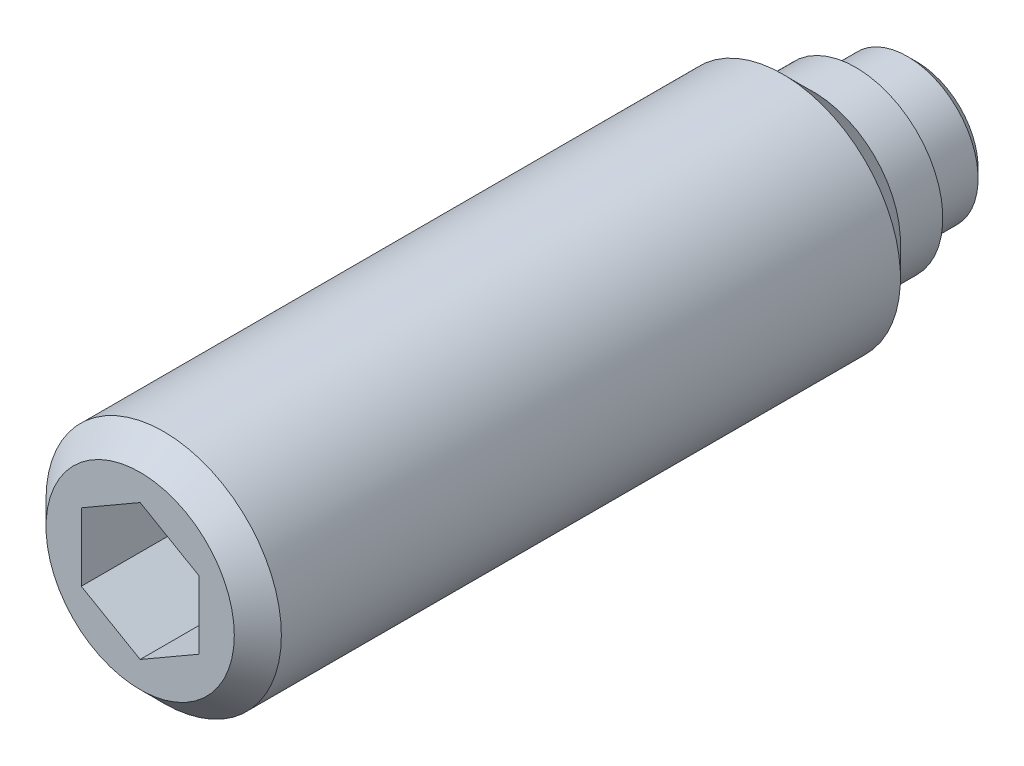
ISO-10303-21;
HEADER;
FILE_DESCRIPTION(('STEP AP214'),'2;1');
FILE_NAME('part.step','',(''),(''),'','','');
FILE_SCHEMA(('AUTOMOTIVE_DESIGN { 1 0 10303 214 1 1 1 1 }'));
ENDSEC;
DATA;
#1=APPLICATION_CONTEXT('core data for automotive mechanical design processes');
#2=APPLICATION_PROTOCOL_DEFINITION('international standard','automotive_design',2000,#1);
#3=PRODUCT_CONTEXT('',#1,'mechanical');
#4=PRODUCT('Part','Part','',(#3));
#5=PRODUCT_RELATED_PRODUCT_CATEGORY('part','',(#4));
#6=PRODUCT_DEFINITION_FORMATION('','',#4);
#7=PRODUCT_DEFINITION_CONTEXT('part definition',#1,'design');
#8=PRODUCT_DEFINITION('design','',#6,#7);
#9=PRODUCT_DEFINITION_SHAPE('','',#8);
#10=(LENGTH_UNIT() NAMED_UNIT(*) SI_UNIT(.MILLI.,.METRE.));
#11=(NAMED_UNIT(*) PLANE_ANGLE_UNIT() SI_UNIT($,.RADIAN.));
#12=(NAMED_UNIT(*) SI_UNIT($,.STERADIAN.) SOLID_ANGLE_UNIT());
#13=UNCERTAINTY_MEASURE_WITH_UNIT(LENGTH_MEASURE(1.E-05),#10,'distance_accuracy_value','');
#14=(GEOMETRIC_REPRESENTATION_CONTEXT(3) GLOBAL_UNCERTAINTY_ASSIGNED_CONTEXT((#13)) GLOBAL_UNIT_ASSIGNED_CONTEXT((#10,
#11,#12)) REPRESENTATION_CONTEXT('',''));
#15=CARTESIAN_POINT('',(0.,0.,0.));
#16=DIRECTION('',(0.,0.,1.));
#17=DIRECTION('',(1.,0.,0.));
#18=AXIS2_PLACEMENT_3D('',#15,#16,#17);
#19=CARTESIAN_POINT('',(0.,0.,1.3));
#20=DIRECTION('',(0.,0.,-1.));
#21=DIRECTION('',(-1.,0.,0.));
#22=AXIS2_PLACEMENT_3D('',#19,#20,#21);
#23=CYLINDRICAL_SURFACE('',#22,2.5);
#24=CARTESIAN_POINT('',(0.,0.,16.));
#25=DIRECTION('',(0.,0.,1.));
#26=DIRECTION('',(1.,0.,0.));
#27=AXIS2_PLACEMENT_3D('',#24,#25,#26);
#28=CIRCLE('',#27,2.5);
#29=CARTESIAN_POINT('',(2.5,0.,16.));
#30=VERTEX_POINT('',#29);
#31=EDGE_CURVE('E9',#30,#30,#28,.F.);
#32=ORIENTED_EDGE('',*,*,#31,.T.);
#33=EDGE_LOOP('',(#32));
#34=FACE_BOUND('',#33,.T.);
#35=CARTESIAN_POINT('',(0.,0.,2.85));
#36=DIRECTION('',(0.,0.,-1.));
#37=DIRECTION('',(-1.,0.,0.));
#38=AXIS2_PLACEMENT_3D('',#35,#36,#37);
#39=CIRCLE('',#38,2.5);
#40=CARTESIAN_POINT('',(-2.5,0.,2.85));
#41=VERTEX_POINT('',#40);
#42=EDGE_CURVE('E136',#41,#41,#39,.T.);
#43=ORIENTED_EDGE('',*,*,#42,.F.);
#44=EDGE_LOOP('',(#43));
#45=FACE_BOUND('',#44,.T.);
#46=ADVANCED_FACE('F14',(#34,#45),#23,.T.);
#47=CARTESIAN_POINT('',(0.,0.,2.85));
#48=DIRECTION('',(0.,0.,1.));
#49=DIRECTION('',(1.,0.,0.));
#50=AXIS2_PLACEMENT_3D('',#47,#48,#49);
#51=CONICAL_SURFACE('',#50,2.5,0.785398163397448);
#52=ORIENTED_EDGE('',*,*,#42,.T.);
#53=EDGE_LOOP('',(#52));
#54=FACE_BOUND('',#53,.T.);
#55=CARTESIAN_POINT('',(0.,0.,2.2));
#56=DIRECTION('',(0.,0.,-1.));
#57=DIRECTION('',(-1.,0.,0.));
#58=AXIS2_PLACEMENT_3D('',#55,#56,#57);
#59=CIRCLE('',#58,1.85);
#60=CARTESIAN_POINT('',(-1.85,0.,2.2));
#61=VERTEX_POINT('',#60);
#62=EDGE_CURVE('E133',#61,#61,#59,.T.);
#63=ORIENTED_EDGE('',*,*,#62,.F.);
#64=EDGE_LOOP('',(#63));
#65=FACE_BOUND('',#64,.T.);
#66=ADVANCED_FACE('F158',(#54,#65),#51,.T.);
#67=CARTESIAN_POINT('',(0.,0.,1.3));
#68=DIRECTION('',(0.,0.,-1.));
#69=DIRECTION('',(-1.,0.,0.));
#70=AXIS2_PLACEMENT_3D('',#67,#68,#69);
#71=CYLINDRICAL_SURFACE('',#70,1.85);
#72=ORIENTED_EDGE('',*,*,#62,.T.);
#73=EDGE_LOOP('',(#72));
#74=FACE_BOUND('',#73,.T.);
#75=CARTESIAN_POINT('',(0.,0.,1.3));
#76=DIRECTION('',(0.,0.,-1.));
#77=DIRECTION('',(-1.,0.,0.));
#78=AXIS2_PLACEMENT_3D('',#75,#76,#77);
#79=CIRCLE('',#78,1.85);
#80=CARTESIAN_POINT('',(-1.85,0.,1.3));
#81=VERTEX_POINT('',#80);
#82=EDGE_CURVE('E130',#81,#81,#79,.T.);
#83=ORIENTED_EDGE('',*,*,#82,.F.);
#84=EDGE_LOOP('',(#83));
#85=FACE_BOUND('',#84,.T.);
#86=ADVANCED_FACE('F163',(#74,#85),#71,.T.);
#87=CARTESIAN_POINT('',(0.,1.85,1.3));
#88=DIRECTION('',(0.,0.,1.));
#89=DIRECTION('',(1.,0.,0.));
#90=AXIS2_PLACEMENT_3D('',#87,#88,#89);
#91=PLANE('',#90);
#92=ORIENTED_EDGE('',*,*,#82,.T.);
#93=EDGE_LOOP('',(#92));
#94=FACE_BOUND('',#93,.T.);
#95=CARTESIAN_POINT('',(0.,0.,1.3));
#96=DIRECTION('',(0.,0.,-1.));
#97=DIRECTION('',(-1.,0.,0.));
#98=AXIS2_PLACEMENT_3D('',#95,#96,#97);
#99=CIRCLE('',#98,1.5);
#100=CARTESIAN_POINT('',(-1.5,0.,1.3));
#101=VERTEX_POINT('',#100);
#102=EDGE_CURVE('E127',#101,#101,#99,.T.);
#103=ORIENTED_EDGE('',*,*,#102,.F.);
#104=EDGE_LOOP('',(#103));
#105=FACE_BOUND('',#104,.T.);
#106=ADVANCED_FACE('F170',(#94,#105),#91,.F.);
#107=CARTESIAN_POINT('',(0.,0.,0.));
#108=DIRECTION('',(0.,0.,-1.));
#109=DIRECTION('',(-1.,0.,0.));
#110=AXIS2_PLACEMENT_3D('',#107,#108,#109);
#111=CYLINDRICAL_SURFACE('',#110,1.5);
#112=CARTESIAN_POINT('',(0.,0.,0.2));
#113=DIRECTION('',(0.,0.,-1.));
#114=DIRECTION('',(-1.,0.,0.));
#115=AXIS2_PLACEMENT_3D('',#112,#113,#114);
#116=CIRCLE('',#115,1.5);
#117=CARTESIAN_POINT('',(-1.5,0.,0.2));
#118=VERTEX_POINT('',#117);
#119=EDGE_CURVE('E124',#118,#118,#116,.T.);
#120=ORIENTED_EDGE('',*,*,#119,.F.);
#121=EDGE_LOOP('',(#120));
#122=FACE_BOUND('',#121,.T.);
#123=ORIENTED_EDGE('',*,*,#102,.T.);
#124=EDGE_LOOP('',(#123));
#125=FACE_BOUND('',#124,.T.);
#126=ADVANCED_FACE('F174',(#122,#125),#111,.T.);
#127=CARTESIAN_POINT('',(0.,0.,0.2));
#128=DIRECTION('',(0.,0.,1.));
#129=DIRECTION('',(1.,0.,0.));
#130=AXIS2_PLACEMENT_3D('',#127,#128,#129);
#131=CONICAL_SURFACE('',#130,1.5,0.785398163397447);
#132=CARTESIAN_POINT('',(0.,0.,0.));
#133=DIRECTION('',(0.,0.,-1.));
#134=DIRECTION('',(-1.,0.,0.));
#135=AXIS2_PLACEMENT_3D('',#132,#133,#134);
#136=CIRCLE('',#135,1.3);
#137=CARTESIAN_POINT('',(-1.3,0.,0.));
#138=VERTEX_POINT('',#137);
#139=EDGE_CURVE('E116',#138,#138,#136,.T.);
#140=ORIENTED_EDGE('',*,*,#139,.F.);
#141=EDGE_LOOP('',(#140));
#142=FACE_BOUND('',#141,.T.);
#143=ORIENTED_EDGE('',*,*,#119,.T.);
#144=EDGE_LOOP('',(#143));
#145=FACE_BOUND('',#144,.T.);
#146=ADVANCED_FACE('F178',(#142,#145),#131,.T.);
#147=CARTESIAN_POINT('',(0.,1.3,0.));
#148=DIRECTION('',(0.,0.,1.));
#149=DIRECTION('',(1.,0.,0.));
#150=AXIS2_PLACEMENT_3D('',#147,#148,#149);
#151=PLANE('',#150);
#152=ORIENTED_EDGE('',*,*,#139,.T.);
#153=EDGE_LOOP('',(#152));
#154=FACE_BOUND('',#153,.T.);
#155=ADVANCED_FACE('F153',(#154),#151,.F.);
#156=CARTESIAN_POINT('',(0.,0.,16.5));
#157=DIRECTION('',(0.,0.,1.));
#158=DIRECTION('',(1.,0.,0.));
#159=AXIS2_PLACEMENT_3D('',#156,#157,#158);
#160=PLANE('',#159);
#161=DIRECTION('',(0.866025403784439,-0.5,0.));
#162=VECTOR('',#161,1.);
#163=CARTESIAN_POINT('',(-1.25,-0.721687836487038,16.5));
#164=LINE('',#163,#162);
#165=CARTESIAN_POINT('',(-1.25,-0.721687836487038,16.5));
#166=VERTEX_POINT('',#165);
#167=CARTESIAN_POINT('',(0.,-1.44337567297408,16.5));
#168=VERTEX_POINT('',#167);
#169=EDGE_CURVE('E29',#166,#168,#164,.T.);
#170=ORIENTED_EDGE('',*,*,#169,.F.);
#171=DIRECTION('',(0.,-1.,0.));
#172=VECTOR('',#171,1.);
#173=CARTESIAN_POINT('',(-1.25,0.721687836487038,16.5));
#174=LINE('',#173,#172);
#175=CARTESIAN_POINT('',(-1.25,0.721687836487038,16.5));
#176=VERTEX_POINT('',#175);
#177=EDGE_CURVE('E112',#176,#166,#174,.T.);
#178=ORIENTED_EDGE('',*,*,#177,.F.);
#179=DIRECTION('',(-0.866025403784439,-0.5,0.));
#180=VECTOR('',#179,1.);
#181=CARTESIAN_POINT('',(0.,1.44337567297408,16.5));
#182=LINE('',#181,#180);
#183=CARTESIAN_POINT('',(0.,1.44337567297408,16.5));
#184=VERTEX_POINT('',#183);
#185=EDGE_CURVE('E110',#184,#176,#182,.T.);
#186=ORIENTED_EDGE('',*,*,#185,.F.);
#187=DIRECTION('',(-0.866025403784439,0.5,0.));
#188=VECTOR('',#187,1.);
#189=CARTESIAN_POINT('',(1.25,0.721687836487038,16.5));
#190=LINE('',#189,#188);
#191=CARTESIAN_POINT('',(1.25,0.721687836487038,16.5));
#192=VERTEX_POINT('',#191);
#193=EDGE_CURVE('E77',#192,#184,#190,.T.);
#194=ORIENTED_EDGE('',*,*,#193,.F.);
#195=DIRECTION('',(0.,1.,0.));
#196=VECTOR('',#195,1.);
#197=CARTESIAN_POINT('',(1.25,-0.721687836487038,16.5));
#198=LINE('',#197,#196);
#199=CARTESIAN_POINT('',(1.25,-0.721687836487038,16.5));
#200=VERTEX_POINT('',#199);
#201=EDGE_CURVE('E106',#200,#192,#198,.T.);
#202=ORIENTED_EDGE('',*,*,#201,.F.);
#203=DIRECTION('',(0.866025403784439,0.5,0.));
#204=VECTOR('',#203,1.);
#205=CARTESIAN_POINT('',(0.,-1.44337567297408,16.5));
#206=LINE('',#205,#204);
#207=EDGE_CURVE('E103',#168,#200,#206,.T.);
#208=ORIENTED_EDGE('',*,*,#207,.F.);
#209=EDGE_LOOP('',(#170,#178,#186,#194,#202,#208));
#210=FACE_BOUND('',#209,.T.);
#211=CARTESIAN_POINT('',(0.,0.,16.5));
#212=DIRECTION('',(0.,0.,1.));
#213=DIRECTION('',(1.,0.,0.));
#214=AXIS2_PLACEMENT_3D('',#211,#212,#213);
#215=CIRCLE('',#214,2.);
#216=CARTESIAN_POINT('',(2.,0.,16.5));
#217=VERTEX_POINT('',#216);
#218=EDGE_CURVE('E22',#217,#217,#215,.T.);
#219=ORIENTED_EDGE('',*,*,#218,.T.);
#220=EDGE_LOOP('',(#219));
#221=FACE_BOUND('',#220,.T.);
#222=ADVANCED_FACE('F141',(#210,#221),#160,.T.);
#223=CARTESIAN_POINT('',(0.,0.,16.5));
#224=DIRECTION('',(0.,0.,-1.));
#225=DIRECTION('',(-1.,0.,0.));
#226=AXIS2_PLACEMENT_3D('',#223,#224,#225);
#227=CONICAL_SURFACE('',#226,2.,0.785398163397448);
#228=ORIENTED_EDGE('',*,*,#31,.F.);
#229=EDGE_LOOP('',(#228));
#230=FACE_BOUND('',#229,.T.);
#231=ORIENTED_EDGE('',*,*,#218,.F.);
#232=EDGE_LOOP('',(#231));
#233=FACE_BOUND('',#232,.T.);
#234=ADVANCED_FACE('F16',(#230,#233),#227,.T.);
#235=CARTESIAN_POINT('',(-1.25,-0.721687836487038,13.5));
#236=DIRECTION('',(-0.5,-0.866025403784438,0.));
#237=DIRECTION('',(0.866025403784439,-0.5,0.));
#238=AXIS2_PLACEMENT_3D('',#235,#236,#237);
#239=PLANE('',#238);
#240=ORIENTED_EDGE('',*,*,#169,.T.);
#241=DIRECTION('',(0.,0.,1.));
#242=VECTOR('',#241,1.);
#243=CARTESIAN_POINT('',(0.,-1.44337567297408,13.5));
#244=LINE('',#243,#242);
#245=CARTESIAN_POINT('',(0.,-1.44337567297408,13.5));
#246=VERTEX_POINT('',#245);
#247=EDGE_CURVE('E59',#246,#168,#244,.T.);
#248=ORIENTED_EDGE('',*,*,#247,.F.);
#249=DIRECTION('',(0.866025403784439,-0.5,0.));
#250=VECTOR('',#249,1.);
#251=CARTESIAN_POINT('',(-1.25,-0.721687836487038,13.5));
#252=LINE('',#251,#250);
#253=CARTESIAN_POINT('',(-1.25,-0.721687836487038,13.5));
#254=VERTEX_POINT('',#253);
#255=EDGE_CURVE('E114',#254,#246,#252,.T.);
#256=ORIENTED_EDGE('',*,*,#255,.F.);
#257=DIRECTION('',(0.,0.,1.));
#258=VECTOR('',#257,1.);
#259=CARTESIAN_POINT('',(-1.25,-0.721687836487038,13.5));
#260=LINE('',#259,#258);
#261=EDGE_CURVE('E37',#254,#166,#260,.T.);
#262=ORIENTED_EDGE('',*,*,#261,.T.);
#263=EDGE_LOOP('',(#240,#248,#256,#262));
#264=FACE_BOUND('',#263,.T.);
#265=ADVANCED_FACE('F144',(#264),#239,.F.);
#266=CARTESIAN_POINT('',(-1.25,0.721687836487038,13.5));
#267=DIRECTION('',(-1.,0.,0.));
#268=DIRECTION('',(0.,0.,1.));
#269=AXIS2_PLACEMENT_3D('',#266,#267,#268);
#270=PLANE('',#269);
#271=ORIENTED_EDGE('',*,*,#177,.T.);
#272=ORIENTED_EDGE('',*,*,#261,.F.);
#273=DIRECTION('',(0.,-1.,0.));
#274=VECTOR('',#273,1.);
#275=CARTESIAN_POINT('',(-1.25,0.721687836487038,13.5));
#276=LINE('',#275,#274);
#277=CARTESIAN_POINT('',(-1.25,0.721687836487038,13.5));
#278=VERTEX_POINT('',#277);
#279=EDGE_CURVE('E89',#278,#254,#276,.T.);
#280=ORIENTED_EDGE('',*,*,#279,.F.);
#281=DIRECTION('',(0.,0.,1.));
#282=VECTOR('',#281,1.);
#283=CARTESIAN_POINT('',(-1.25,0.721687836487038,13.5));
#284=LINE('',#283,#282);
#285=EDGE_CURVE('E81',#278,#176,#284,.T.);
#286=ORIENTED_EDGE('',*,*,#285,.T.);
#287=EDGE_LOOP('',(#271,#272,#280,#286));
#288=FACE_BOUND('',#287,.T.);
#289=ADVANCED_FACE('F151',(#288),#270,.F.);
#290=CARTESIAN_POINT('',(0.,1.44337567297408,13.5));
#291=DIRECTION('',(-0.5,0.866025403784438,0.));
#292=DIRECTION('',(-0.866025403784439,-0.5,0.));
#293=AXIS2_PLACEMENT_3D('',#290,#291,#292);
#294=PLANE('',#293);
#295=ORIENTED_EDGE('',*,*,#185,.T.);
#296=ORIENTED_EDGE('',*,*,#285,.F.);
#297=DIRECTION('',(-0.866025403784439,-0.5,0.));
#298=VECTOR('',#297,1.);
#299=CARTESIAN_POINT('',(0.,1.44337567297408,13.5));
#300=LINE('',#299,#298);
#301=CARTESIAN_POINT('',(0.,1.44337567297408,13.5));
#302=VERTEX_POINT('',#301);
#303=EDGE_CURVE('E85',#302,#278,#300,.T.);
#304=ORIENTED_EDGE('',*,*,#303,.F.);
#305=DIRECTION('',(0.,0.,1.));
#306=VECTOR('',#305,1.);
#307=CARTESIAN_POINT('',(0.,1.44337567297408,13.5));
#308=LINE('',#307,#306);
#309=EDGE_CURVE('E70',#302,#184,#308,.T.);
#310=ORIENTED_EDGE('',*,*,#309,.T.);
#311=EDGE_LOOP('',(#295,#296,#304,#310));
#312=FACE_BOUND('',#311,.T.);
#313=ADVANCED_FACE('F86',(#312),#294,.F.);
#314=CARTESIAN_POINT('',(1.25,0.721687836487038,13.5));
#315=DIRECTION('',(0.5,0.866025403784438,0.));
#316=DIRECTION('',(-0.866025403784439,0.5,0.));
#317=AXIS2_PLACEMENT_3D('',#314,#315,#316);
#318=PLANE('',#317);
#319=ORIENTED_EDGE('',*,*,#193,.T.);
#320=ORIENTED_EDGE('',*,*,#309,.F.);
#321=DIRECTION('',(-0.866025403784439,0.5,0.));
#322=VECTOR('',#321,1.);
#323=CARTESIAN_POINT('',(1.25,0.721687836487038,13.5));
#324=LINE('',#323,#322);
#325=CARTESIAN_POINT('',(1.25,0.721687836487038,13.5));
#326=VERTEX_POINT('',#325);
#327=EDGE_CURVE('E74',#326,#302,#324,.T.);
#328=ORIENTED_EDGE('',*,*,#327,.F.);
#329=DIRECTION('',(0.,0.,1.));
#330=VECTOR('',#329,1.);
#331=CARTESIAN_POINT('',(1.25,0.721687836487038,13.5));
#332=LINE('',#331,#330);
#333=EDGE_CURVE('E82',#326,#192,#332,.T.);
#334=ORIENTED_EDGE('',*,*,#333,.T.);
#335=EDGE_LOOP('',(#319,#320,#328,#334));
#336=FACE_BOUND('',#335,.T.);
#337=ADVANCED_FACE('F72',(#336),#318,.F.);
#338=CARTESIAN_POINT('',(1.25,-0.721687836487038,13.5));
#339=DIRECTION('',(1.,0.,0.));
#340=DIRECTION('',(0.,0.,-1.));
#341=AXIS2_PLACEMENT_3D('',#338,#339,#340);
#342=PLANE('',#341);
#343=ORIENTED_EDGE('',*,*,#201,.T.);
#344=ORIENTED_EDGE('',*,*,#333,.F.);
#345=DIRECTION('',(0.,1.,0.));
#346=VECTOR('',#345,1.);
#347=CARTESIAN_POINT('',(1.25,-0.721687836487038,13.5));
#348=LINE('',#347,#346);
#349=CARTESIAN_POINT('',(1.25,-0.721687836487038,13.5));
#350=VERTEX_POINT('',#349);
#351=EDGE_CURVE('E95',#350,#326,#348,.T.);
#352=ORIENTED_EDGE('',*,*,#351,.F.);
#353=DIRECTION('',(0.,0.,1.));
#354=VECTOR('',#353,1.);
#355=CARTESIAN_POINT('',(1.25,-0.721687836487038,13.5));
#356=LINE('',#355,#354);
#357=EDGE_CURVE('E119',#350,#200,#356,.T.);
#358=ORIENTED_EDGE('',*,*,#357,.T.);
#359=EDGE_LOOP('',(#343,#344,#352,#358));
#360=FACE_BOUND('',#359,.T.);
#361=ADVANCED_FACE('F189',(#360),#342,.F.);
#362=CARTESIAN_POINT('',(0.,-1.44337567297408,13.5));
#363=DIRECTION('',(0.5,-0.866025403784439,0.));
#364=DIRECTION('',(0.866025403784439,0.5,0.));
#365=AXIS2_PLACEMENT_3D('',#362,#363,#364);
#366=PLANE('',#365);
#367=ORIENTED_EDGE('',*,*,#207,.T.);
#368=ORIENTED_EDGE('',*,*,#357,.F.);
#369=DIRECTION('',(0.866025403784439,0.5,0.));
#370=VECTOR('',#369,1.);
#371=CARTESIAN_POINT('',(0.,-1.44337567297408,13.5));
#372=LINE('',#371,#370);
#373=EDGE_CURVE('E97',#246,#350,#372,.T.);
#374=ORIENTED_EDGE('',*,*,#373,.F.);
#375=ORIENTED_EDGE('',*,*,#247,.T.);
#376=EDGE_LOOP('',(#367,#368,#374,#375));
#377=FACE_BOUND('',#376,.T.);
#378=ADVANCED_FACE('F186',(#377),#366,.F.);
#379=CARTESIAN_POINT('',(0.,0.,13.5));
#380=DIRECTION('',(0.,0.,1.));
#381=DIRECTION('',(1.,0.,0.));
#382=AXIS2_PLACEMENT_3D('',#379,#380,#381);
#383=PLANE('',#382);
#384=ORIENTED_EDGE('',*,*,#255,.T.);
#385=ORIENTED_EDGE('',*,*,#373,.T.);
#386=ORIENTED_EDGE('',*,*,#351,.T.);
#387=ORIENTED_EDGE('',*,*,#327,.T.);
#388=ORIENTED_EDGE('',*,*,#303,.T.);
#389=ORIENTED_EDGE('',*,*,#279,.T.);
#390=EDGE_LOOP('',(#384,#385,#386,#387,#388,#389));
#391=FACE_BOUND('',#390,.T.);
#392=ADVANCED_FACE('F92',(#391),#383,.T.);
#393=CLOSED_SHELL('',(#46,#66,#86,#106,#126,#146,#155,#222,#234,#265,#289,#313,#337,#361,#378,#392));
#394=MANIFOLD_SOLID_BREP('B1',#393);
#395=ADVANCED_BREP_SHAPE_REPRESENTATION('',(#18,#394),#14);
#396=SHAPE_DEFINITION_REPRESENTATION(#9,#395);
ENDSEC;
END-ISO-10303-21;
